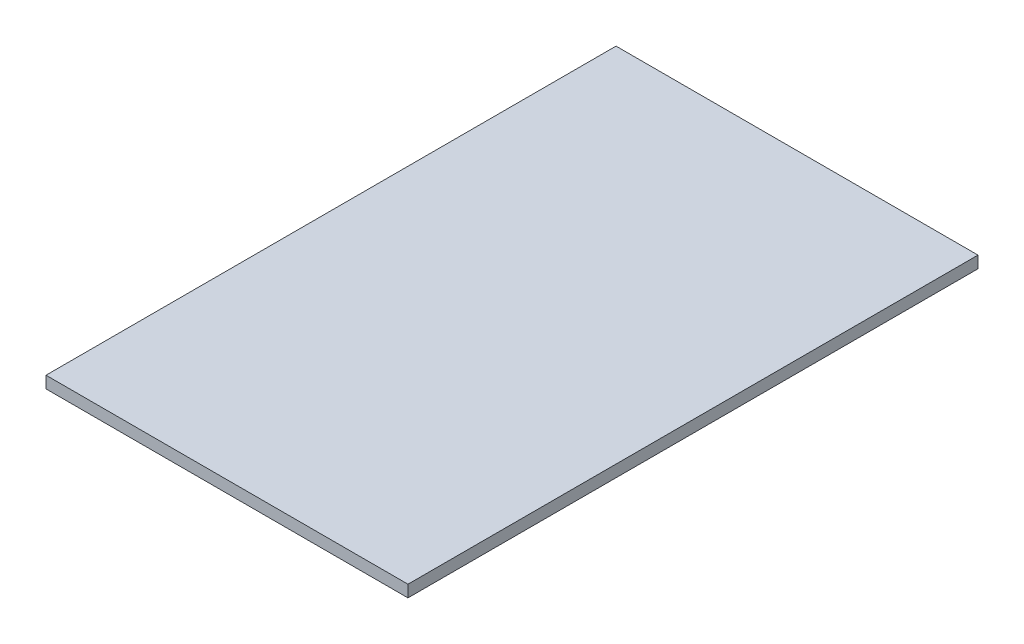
from build123d import *

# Parameters (mm, degrees)
SKETCH1_W           = 76.2
SKETCH1_H           = 120
BOSS_EXTRUDE1_DEPTH = 2.5


with BuildPart() as part:
    # Sketch1 → Boss-Extrude1 (new body)
    with BuildSketch(Plane(origin=(0, 0, 0), x_dir=(1, 0, 0), z_dir=(0, 1, 0))):
        Rectangle(SKETCH1_W, SKETCH1_H)
    extrude(amount=BOSS_EXTRUDE1_DEPTH)


solid = part.part
